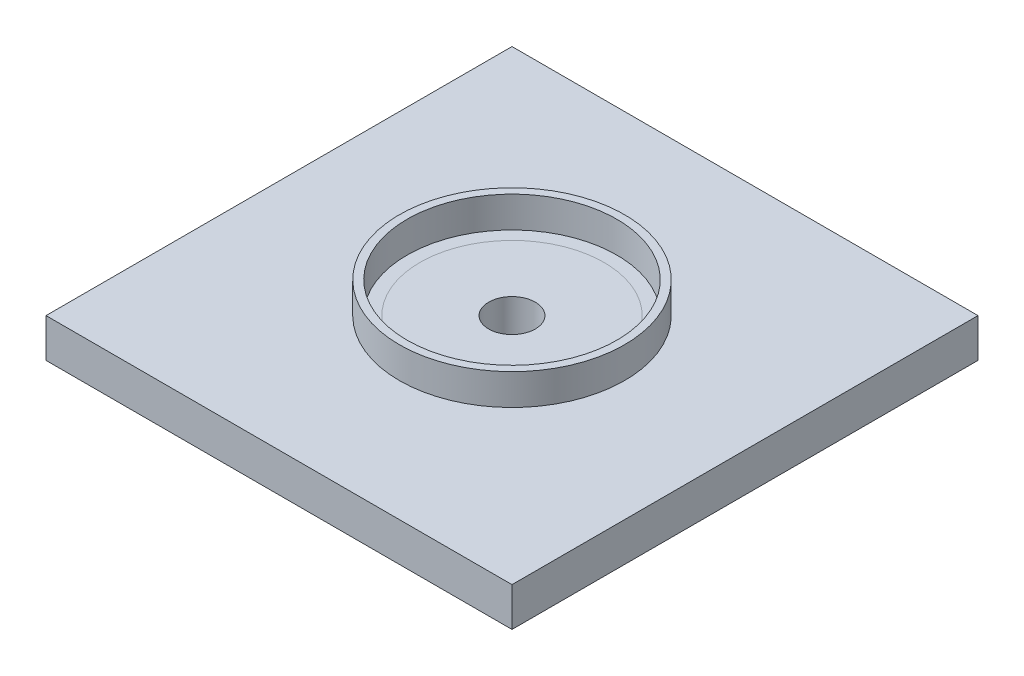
from build123d import *

# Parameters (mm, degrees)
SKETCH1_W      = 152.4
SKETCH1_H      = 152.4
SKETCH1_R      = 7.62
EXTRUDE1_DEPTH = 12.7
SKETCH2_R      = 36.83
SKETCH2_R_2    = 34.29
EXTRUDE2_DEPTH = 10.16


with BuildPart() as part:
    # Sketch1 → Extrude1 (new body)
    with BuildSketch(Plane(origin=(0, 0, 0), x_dir=(1, 0, 0), z_dir=(0, 1, 0))):
        Rectangle(SKETCH1_W, SKETCH1_H)
        with Locations(Location((0, 0, 0), (0, 0, 270))):
            Circle(SKETCH1_R, mode=Mode.SUBTRACT)
    extrude(amount=EXTRUDE1_DEPTH)

    # Sketch2 → Extrude2 (add)
    with BuildSketch(Plane(origin=(0, 12.7, 0), x_dir=(1, 0, 0), z_dir=(0, 1, 0))):
        with Locations(Location((0, 0, 0), (0, 0, 270))):
            Circle(SKETCH2_R)
        with Locations(Location((0, 0, 0), (0, 0, 270))):
            Circle(SKETCH2_R_2, mode=Mode.SUBTRACT)
    extrude(amount=EXTRUDE2_DEPTH)


solid = part.part
